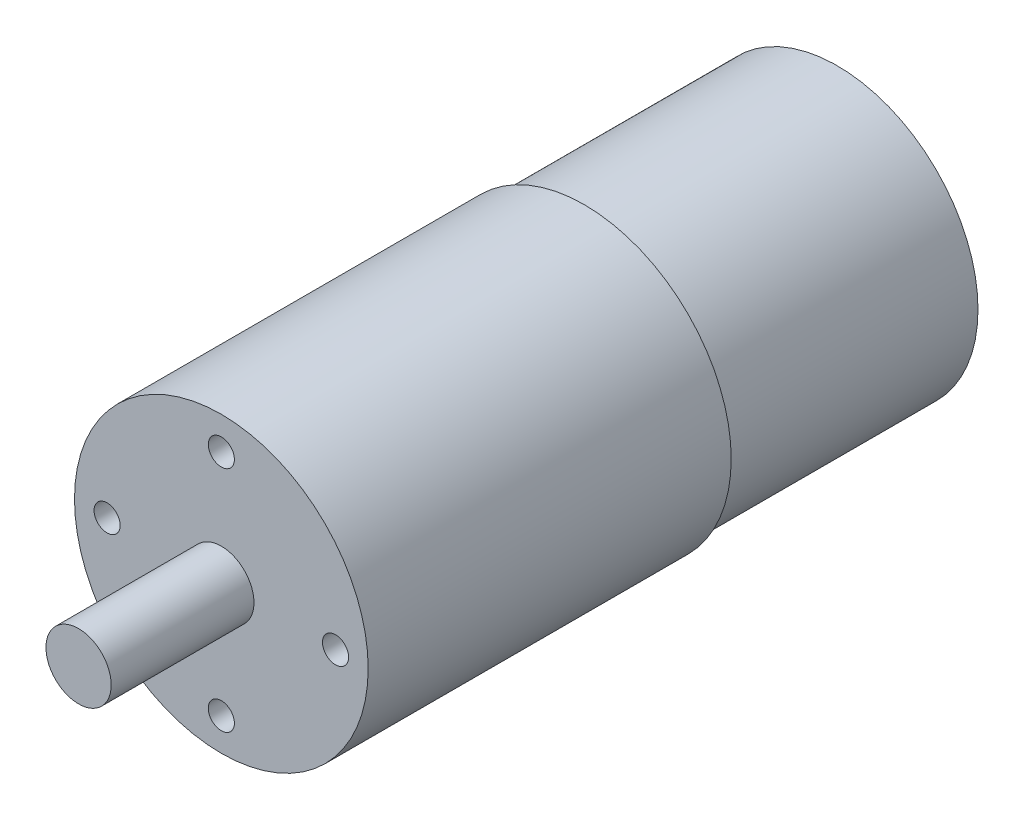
from build123d import *

# Parameters (mm, degrees)
SKETCH_1_R          = 17.25
EXTRUDE_1_DEPTH     = 31
SKETCH_2_R          = 18
EXTRUDE_2_DEPTH     = 44.5
SKETCH_3_R          = 4
EXTRUDE_3_DEPTH     = 17.5
SKETCH_4_R          = 1.6
CUT_EXTRUDE_1_DEPTH = 5
SKETCH_6_R          = 0.75
EXTRUDE_4_DEPTH     = 0.5


with BuildPart() as part:
    # Sketch 1 → Extrude 1 (new body)
    with BuildSketch(Plane.XY):
        Circle(SKETCH_1_R)
    extrude(amount=EXTRUDE_1_DEPTH)

    # Sketch 2 → Extrude 2 (add)
    with BuildSketch(Plane.XY.offset(31)):
        Circle(SKETCH_2_R)
    extrude(amount=EXTRUDE_2_DEPTH)

    # Sketch 3 → Extrude 3 (add)
    with BuildSketch(Plane.XY.offset(75.5)):
        Circle(SKETCH_3_R)
    extrude(amount=EXTRUDE_3_DEPTH)

    # Sketch 4 → Cut-Extrude 1 (cut)
    with BuildSketch(Plane.XY.offset(75.5)):
        with Locations((0, 14)):
            Circle(SKETCH_4_R)
        with Locations((14, 0)):
            Circle(SKETCH_4_R)
        with Locations((0, -14)):
            Circle(SKETCH_4_R)
        with Locations((-14, 0)):
            Circle(SKETCH_4_R)
    extrude(amount=-CUT_EXTRUDE_1_DEPTH, mode=Mode.SUBTRACT)

    # Sketch 6 → Extrude 4 (add, symmetric)
    # profile 1 of 2: a face of its own
    with BuildSketch(Plane(origin=(0, 0, 0), x_dir=(1, 0, 0), z_dir=(0, 1, 0))):
        with BuildLine():
            Line((-11, 2), (-11, 0))
            Line((-11, 0), (-9, 0))
            Line((-9, 0), (-9, 2))
            ThreePointArc((-9, 2), (-10, 3), (-11, 2))
        make_face()
        with Locations(Location((-10, 2, 0), (0, 0, 270))):
            Circle(SKETCH_6_R, mode=Mode.SUBTRACT)
    # profile 2 of 2: a face of its own
    with BuildSketch(Plane(origin=(0, 0, 0), x_dir=(1, 0, 0), z_dir=(0, 1, 0))):
        with BuildLine():
            Line((9, 0), (9, 2))
            ThreePointArc((9, 2), (10, 3), (11, 2))
            Line((11, 2), (11, 0))
            Line((11, 0), (9, 0))
        make_face()
        with Locations(Location((10, 2, 0), (0, 0, 90))):
            Circle(SKETCH_6_R, mode=Mode.SUBTRACT)
    extrude(amount=EXTRUDE_4_DEPTH, both=True)


solid = part.part
